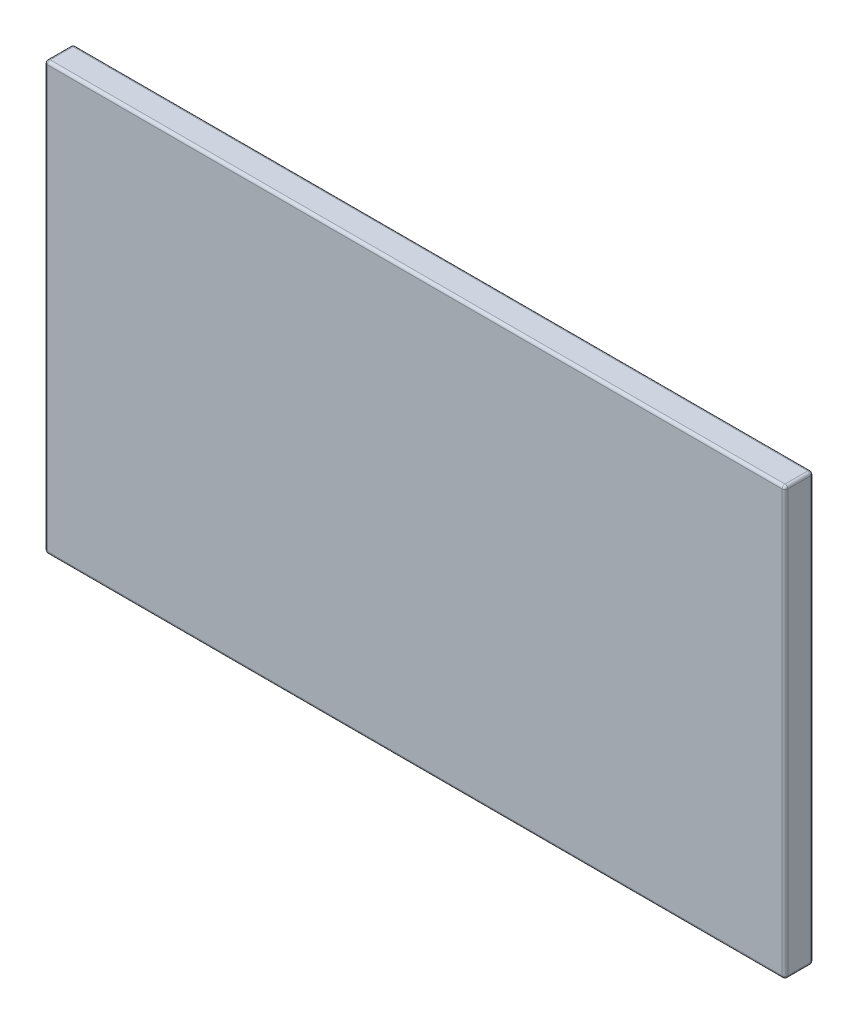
from build123d import *

# Parameters (mm, degrees)
SKIZZE1_W                       = 1300
SKIZZE1_H                       = 750
AUFSATZ_LINEAR_AUSTRAGEN1_DEPTH = 50
VERRUNDUNG1_R                   = 5


with BuildPart() as part:
    # Skizze1 → Aufsatz-Linear austragen1 (new body)
    with BuildSketch(Plane.XY):
        Rectangle(SKIZZE1_W, SKIZZE1_H)
    extrude(amount=AUFSATZ_LINEAR_AUSTRAGEN1_DEPTH)

    # Verrundung1
    verrundung1_edges = [part.edges().sort_by_distance(p)[0] for p in [
        (-650, 0, 50),
        (0, -375, 50),
        (650, 0, 50),
        (0, -375, 0),
        (-650, 0, 0),
        (0, 375, 0),
        (650, 0, 0),
        (650, -375, 25),
        (-650, -375, 25),
        (-650, 375, 25),
        (650, 375, 25),
        (0, 375, 50),
    ]]
    fillet(verrundung1_edges, radius=VERRUNDUNG1_R)


solid = part.part
